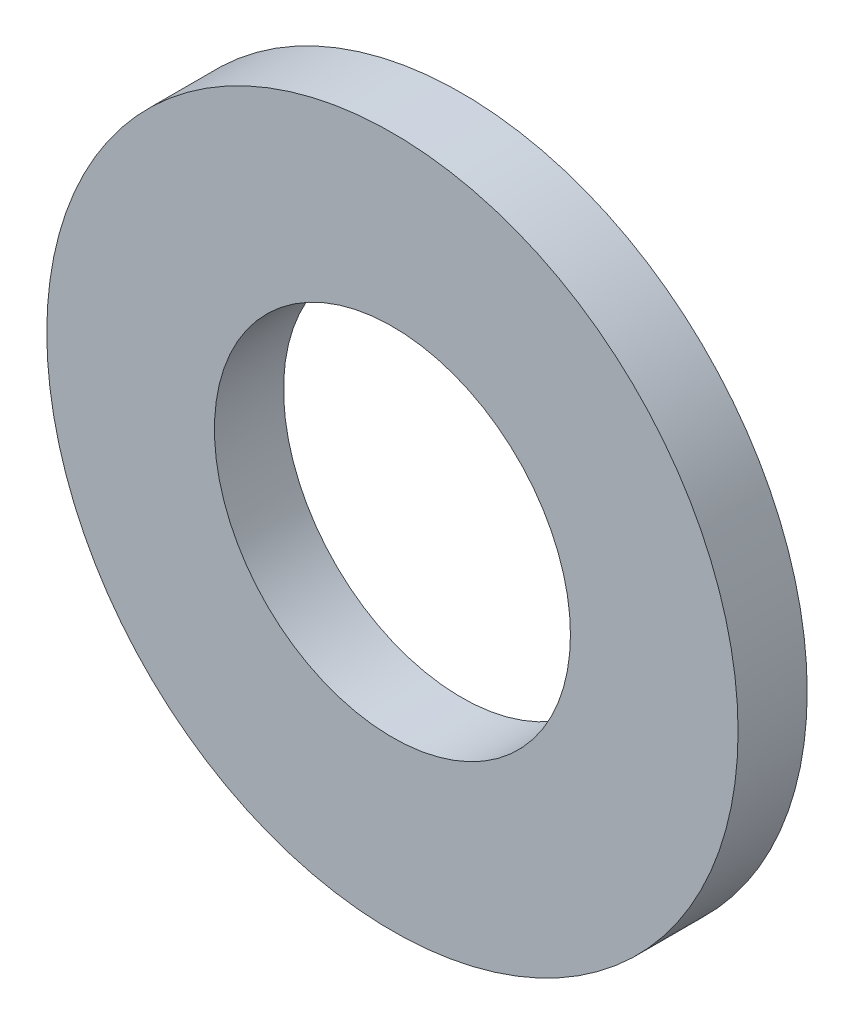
from build123d import *

# Parameters (mm, degrees)
SKETCH_1_R      = 10
SKETCH_1_R_2    = 5.15
EXTRUDE_1_DEPTH = 2


with BuildPart() as part:
    # Sketch 1 → Extrude 1 (new body)
    with BuildSketch(Plane.XY):
        with Locations((-30.625238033, 42.404175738)):
            Circle(SKETCH_1_R)
        with Locations((-30.625238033, 42.404175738)):
            Circle(SKETCH_1_R_2, mode=Mode.SUBTRACT)
    extrude(amount=EXTRUDE_1_DEPTH)


solid = part.part
